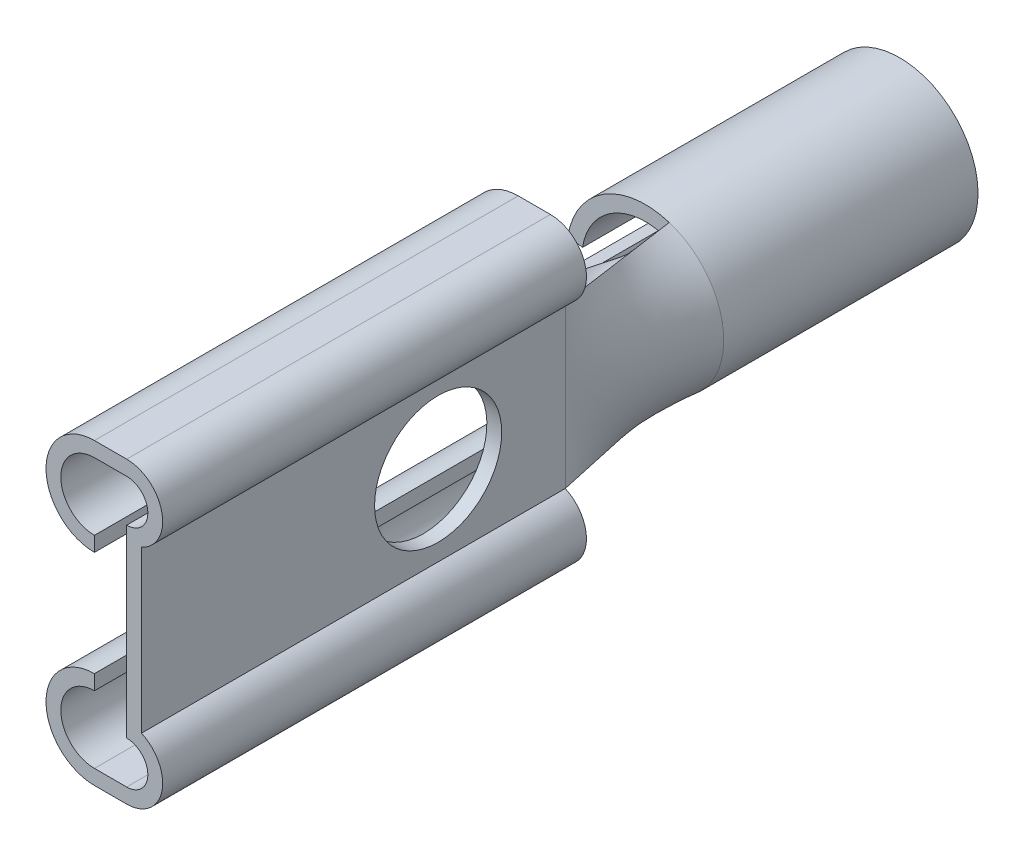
ISO-10303-21;
HEADER;
FILE_DESCRIPTION(('STEP AP214'),'2;1');
FILE_NAME('part.step','',(''),(''),'','','');
FILE_SCHEMA(('AUTOMOTIVE_DESIGN { 1 0 10303 214 1 1 1 1 }'));
ENDSEC;
DATA;
#1=APPLICATION_CONTEXT('core data for automotive mechanical design processes');
#2=APPLICATION_PROTOCOL_DEFINITION('international standard','automotive_design',2000,#1);
#3=PRODUCT_CONTEXT('',#1,'mechanical');
#4=PRODUCT('Part','Part','',(#3));
#5=PRODUCT_RELATED_PRODUCT_CATEGORY('part','',(#4));
#6=PRODUCT_DEFINITION_FORMATION('','',#4);
#7=PRODUCT_DEFINITION_CONTEXT('part definition',#1,'design');
#8=PRODUCT_DEFINITION('design','',#6,#7);
#9=PRODUCT_DEFINITION_SHAPE('','',#8);
#10=(LENGTH_UNIT() NAMED_UNIT(*) SI_UNIT(.MILLI.,.METRE.));
#11=(NAMED_UNIT(*) PLANE_ANGLE_UNIT() SI_UNIT($,.RADIAN.));
#12=(NAMED_UNIT(*) SI_UNIT($,.STERADIAN.) SOLID_ANGLE_UNIT());
#13=UNCERTAINTY_MEASURE_WITH_UNIT(LENGTH_MEASURE(1.E-05),#10,'distance_accuracy_value','');
#14=(GEOMETRIC_REPRESENTATION_CONTEXT(3) GLOBAL_UNCERTAINTY_ASSIGNED_CONTEXT((#13)) GLOBAL_UNIT_ASSIGNED_CONTEXT((#10,
#11,#12)) REPRESENTATION_CONTEXT('',''));
#15=CARTESIAN_POINT('',(0.,0.,0.));
#16=DIRECTION('',(0.,0.,1.));
#17=DIRECTION('',(1.,0.,0.));
#18=AXIS2_PLACEMENT_3D('',#15,#16,#17);
#19=CARTESIAN_POINT('',(0.759999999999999,2.675,0.));
#20=DIRECTION('',(0.,0.,1.));
#21=DIRECTION('',(1.,0.,0.));
#22=AXIS2_PLACEMENT_3D('',#19,#20,#21);
#23=PLANE('',#22);
#24=DIRECTION('',(0.786758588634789,0.617260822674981,0.));
#25=VECTOR('',#24,1.);
#26=CARTESIAN_POINT('',(0.759999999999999,-2.175,0.));
#27=LINE('',#26,#25);
#28=CARTESIAN_POINT('',(1.11,-1.90040333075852,0.));
#29=VERTEX_POINT('',#28);
#30=CARTESIAN_POINT('',(0.759999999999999,-2.175,0.));
#31=VERTEX_POINT('',#30);
#32=EDGE_CURVE('E12',#29,#31,#27,.F.);
#33=ORIENTED_EDGE('',*,*,#32,.F.);
#34=CARTESIAN_POINT('',(0.759999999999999,-2.675,0.));
#35=DIRECTION('',(0.,0.,-1.));
#36=DIRECTION('',(1.,0.,0.));
#37=AXIS2_PLACEMENT_3D('',#34,#35,#36);
#38=CIRCLE('',#37,0.85);
#39=CARTESIAN_POINT('',(0.759999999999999,-3.525,0.));
#40=VERTEX_POINT('',#39);
#41=EDGE_CURVE('E250',#40,#29,#38,.F.);
#42=ORIENTED_EDGE('',*,*,#41,.F.);
#43=DIRECTION('',(1.,0.,0.));
#44=VECTOR('',#43,1.);
#45=CARTESIAN_POINT('',(0.,-3.525,0.));
#46=LINE('',#45,#44);
#47=CARTESIAN_POINT('',(0.,-3.525,0.));
#48=VERTEX_POINT('',#47);
#49=EDGE_CURVE('E252',#48,#40,#46,.T.);
#50=ORIENTED_EDGE('',*,*,#49,.F.);
#51=CARTESIAN_POINT('',(0.,-2.38184886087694,0.));
#52=DIRECTION('',(0.,0.,-1.));
#53=DIRECTION('',(1.,0.,0.));
#54=AXIS2_PLACEMENT_3D('',#51,#52,#53);
#55=CIRCLE('',#54,1.14315113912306);
#56=CARTESIAN_POINT('',(0.,-1.23869772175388,0.));
#57=VERTEX_POINT('',#56);
#58=EDGE_CURVE('E531',#57,#48,#55,.F.);
#59=ORIENTED_EDGE('',*,*,#58,.F.);
#60=DIRECTION('',(0.,1.,0.));
#61=VECTOR('',#60,1.);
#62=CARTESIAN_POINT('',(0.,-1.58869772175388,0.));
#63=LINE('',#62,#61);
#64=CARTESIAN_POINT('',(0.,-1.58869772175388,0.));
#65=VERTEX_POINT('',#64);
#66=EDGE_CURVE('E534',#65,#57,#63,.T.);
#67=ORIENTED_EDGE('',*,*,#66,.F.);
#68=CARTESIAN_POINT('',(0.,-2.38184886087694,0.));
#69=DIRECTION('',(0.,0.,1.));
#70=DIRECTION('',(1.,0.,0.));
#71=AXIS2_PLACEMENT_3D('',#68,#69,#70);
#72=CIRCLE('',#71,0.793151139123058);
#73=CARTESIAN_POINT('',(0.,-3.175,0.));
#74=VERTEX_POINT('',#73);
#75=EDGE_CURVE('E540',#65,#74,#72,.T.);
#76=ORIENTED_EDGE('',*,*,#75,.T.);
#77=DIRECTION('',(1.,0.,0.));
#78=VECTOR('',#77,1.);
#79=CARTESIAN_POINT('',(0.,-3.175,0.));
#80=LINE('',#79,#78);
#81=CARTESIAN_POINT('',(0.759999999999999,-3.175,0.));
#82=VERTEX_POINT('',#81);
#83=EDGE_CURVE('E244',#74,#82,#80,.T.);
#84=ORIENTED_EDGE('',*,*,#83,.T.);
#85=CARTESIAN_POINT('',(0.759999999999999,-2.675,0.));
#86=DIRECTION('',(0.,0.,1.));
#87=DIRECTION('',(-1.,0.,0.));
#88=AXIS2_PLACEMENT_3D('',#85,#86,#87);
#89=CIRCLE('',#88,0.5);
#90=EDGE_CURVE('E241',#82,#31,#89,.T.);
#91=ORIENTED_EDGE('',*,*,#90,.T.);
#92=EDGE_LOOP('',(#33,#42,#50,#59,#67,#76,#84,#91));
#93=FACE_BOUND('',#92,.T.);
#94=ADVANCED_FACE('F55',(#93),#23,.F.);
#95=DIRECTION('',(-0.786758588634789,0.617260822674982,0.));
#96=VECTOR('',#95,1.);
#97=CARTESIAN_POINT('',(1.11,1.90040333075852,0.));
#98=LINE('',#97,#96);
#99=CARTESIAN_POINT('',(0.759999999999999,2.175,0.));
#100=VERTEX_POINT('',#99);
#101=CARTESIAN_POINT('',(1.11,1.90040333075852,0.));
#102=VERTEX_POINT('',#101);
#103=EDGE_CURVE('E66',#100,#102,#98,.F.);
#104=ORIENTED_EDGE('',*,*,#103,.F.);
#105=CARTESIAN_POINT('',(0.759999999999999,2.675,0.));
#106=DIRECTION('',(0.,0.,-1.));
#107=DIRECTION('',(-1.,0.,0.));
#108=AXIS2_PLACEMENT_3D('',#105,#106,#107);
#109=CIRCLE('',#108,0.5);
#110=CARTESIAN_POINT('',(0.759999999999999,3.175,0.));
#111=VERTEX_POINT('',#110);
#112=EDGE_CURVE('E222',#111,#100,#109,.T.);
#113=ORIENTED_EDGE('',*,*,#112,.F.);
#114=DIRECTION('',(1.,0.,0.));
#115=VECTOR('',#114,1.);
#116=CARTESIAN_POINT('',(0.,3.175,0.));
#117=LINE('',#116,#115);
#118=CARTESIAN_POINT('',(0.,3.175,0.));
#119=VERTEX_POINT('',#118);
#120=EDGE_CURVE('E220',#119,#111,#117,.T.);
#121=ORIENTED_EDGE('',*,*,#120,.F.);
#122=CARTESIAN_POINT('',(0.,2.38184886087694,0.));
#123=DIRECTION('',(0.,0.,-1.));
#124=DIRECTION('',(1.,0.,0.));
#125=AXIS2_PLACEMENT_3D('',#122,#123,#124);
#126=CIRCLE('',#125,0.793151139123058);
#127=CARTESIAN_POINT('',(0.,1.58869772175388,0.));
#128=VERTEX_POINT('',#127);
#129=EDGE_CURVE('E196',#128,#119,#126,.T.);
#130=ORIENTED_EDGE('',*,*,#129,.F.);
#131=DIRECTION('',(0.,-1.,0.));
#132=VECTOR('',#131,1.);
#133=CARTESIAN_POINT('',(0.,1.58869772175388,0.));
#134=LINE('',#133,#132);
#135=CARTESIAN_POINT('',(0.,1.23869772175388,0.));
#136=VERTEX_POINT('',#135);
#137=EDGE_CURVE('E216',#128,#136,#134,.T.);
#138=ORIENTED_EDGE('',*,*,#137,.T.);
#139=CARTESIAN_POINT('',(0.,2.38184886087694,0.));
#140=DIRECTION('',(0.,0.,1.));
#141=DIRECTION('',(1.,0.,0.));
#142=AXIS2_PLACEMENT_3D('',#139,#140,#141);
#143=CIRCLE('',#142,1.14315113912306);
#144=CARTESIAN_POINT('',(0.,3.525,0.));
#145=VERTEX_POINT('',#144);
#146=EDGE_CURVE('E212',#136,#145,#143,.F.);
#147=ORIENTED_EDGE('',*,*,#146,.T.);
#148=DIRECTION('',(1.,0.,0.));
#149=VECTOR('',#148,1.);
#150=CARTESIAN_POINT('',(0.,3.525,0.));
#151=LINE('',#150,#149);
#152=CARTESIAN_POINT('',(0.759999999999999,3.525,0.));
#153=VERTEX_POINT('',#152);
#154=EDGE_CURVE('E209',#145,#153,#151,.T.);
#155=ORIENTED_EDGE('',*,*,#154,.T.);
#156=CARTESIAN_POINT('',(0.759999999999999,2.675,0.));
#157=DIRECTION('',(0.,0.,1.));
#158=DIRECTION('',(1.,0.,0.));
#159=AXIS2_PLACEMENT_3D('',#156,#157,#158);
#160=CIRCLE('',#159,0.85);
#161=EDGE_CURVE('E213',#153,#102,#160,.F.);
#162=ORIENTED_EDGE('',*,*,#161,.T.);
#163=EDGE_LOOP('',(#104,#113,#121,#130,#138,#147,#155,#162));
#164=FACE_BOUND('',#163,.T.);
#165=ADVANCED_FACE('F452',(#164),#23,.F.);
#166=CARTESIAN_POINT('',(0.759999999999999,2.175,10.));
#167=DIRECTION('',(1.,0.,0.));
#168=DIRECTION('',(0.,1.,0.));
#169=AXIS2_PLACEMENT_3D('',#166,#167,#168);
#170=PLANE('',#169);
#171=CARTESIAN_POINT('',(0.759999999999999,0.,3.));
#172=DIRECTION('',(-1.,0.,0.));
#173=DIRECTION('',(0.,-1.,0.));
#174=AXIS2_PLACEMENT_3D('',#171,#172,#173);
#175=CIRCLE('',#174,1.5);
#176=CARTESIAN_POINT('',(0.759999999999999,-1.5,3.));
#177=VERTEX_POINT('',#176);
#178=EDGE_CURVE('E602',#177,#177,#175,.T.);
#179=ORIENTED_EDGE('',*,*,#178,.F.);
#180=EDGE_LOOP('',(#179));
#181=FACE_BOUND('',#180,.T.);
#182=DIRECTION('',(0.,1.,0.));
#183=VECTOR('',#182,1.);
#184=CARTESIAN_POINT('',(0.759999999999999,2.175,0.));
#185=LINE('',#184,#183);
#186=EDGE_CURVE('E257',#100,#31,#185,.F.);
#187=ORIENTED_EDGE('',*,*,#186,.T.);
#188=DIRECTION('',(0.,0.,-1.));
#189=VECTOR('',#188,1.);
#190=CARTESIAN_POINT('',(0.759999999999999,-2.175,10.));
#191=LINE('',#190,#189);
#192=CARTESIAN_POINT('',(0.759999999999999,-2.175,10.));
#193=VERTEX_POINT('',#192);
#194=EDGE_CURVE('E245',#193,#31,#191,.T.);
#195=ORIENTED_EDGE('',*,*,#194,.F.);
#196=DIRECTION('',(0.,-1.,0.));
#197=VECTOR('',#196,1.);
#198=CARTESIAN_POINT('',(0.759999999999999,2.175,10.));
#199=LINE('',#198,#197);
#200=CARTESIAN_POINT('',(0.759999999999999,2.175,10.));
#201=VERTEX_POINT('',#200);
#202=EDGE_CURVE('E238',#201,#193,#199,.T.);
#203=ORIENTED_EDGE('',*,*,#202,.F.);
#204=DIRECTION('',(0.,0.,-1.));
#205=VECTOR('',#204,1.);
#206=CARTESIAN_POINT('',(0.759999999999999,2.175,10.));
#207=LINE('',#206,#205);
#208=EDGE_CURVE('E205',#201,#100,#207,.T.);
#209=ORIENTED_EDGE('',*,*,#208,.T.);
#210=EDGE_LOOP('',(#187,#195,#203,#209));
#211=FACE_BOUND('',#210,.T.);
#212=ADVANCED_FACE('F57',(#181,#211),#170,.F.);
#213=CARTESIAN_POINT('',(1.11,2.175,10.));
#214=DIRECTION('',(1.,0.,0.));
#215=DIRECTION('',(0.,1.,0.));
#216=AXIS2_PLACEMENT_3D('',#213,#214,#215);
#217=PLANE('',#216);
#218=CARTESIAN_POINT('',(1.11,0.,3.));
#219=DIRECTION('',(1.,0.,0.));
#220=DIRECTION('',(0.,1.,0.));
#221=AXIS2_PLACEMENT_3D('',#218,#219,#220);
#222=CIRCLE('',#221,1.5);
#223=CARTESIAN_POINT('',(1.11,1.5,3.));
#224=VERTEX_POINT('',#223);
#225=EDGE_CURVE('E59',#224,#224,#222,.T.);
#226=ORIENTED_EDGE('',*,*,#225,.F.);
#227=EDGE_LOOP('',(#226));
#228=FACE_BOUND('',#227,.T.);
#229=DIRECTION('',(0.,1.,0.));
#230=VECTOR('',#229,1.);
#231=CARTESIAN_POINT('',(1.11,2.175,0.));
#232=LINE('',#231,#230);
#233=EDGE_CURVE('E233',#102,#29,#232,.F.);
#234=ORIENTED_EDGE('',*,*,#233,.F.);
#235=DIRECTION('',(0.,0.,-1.));
#236=VECTOR('',#235,1.);
#237=CARTESIAN_POINT('',(1.11,1.90040333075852,10.));
#238=LINE('',#237,#236);
#239=CARTESIAN_POINT('',(1.11,1.90040333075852,10.));
#240=VERTEX_POINT('',#239);
#241=EDGE_CURVE('E231',#240,#102,#238,.T.);
#242=ORIENTED_EDGE('',*,*,#241,.F.);
#243=DIRECTION('',(0.,-1.,0.));
#244=VECTOR('',#243,1.);
#245=CARTESIAN_POINT('',(1.11,2.175,10.));
#246=LINE('',#245,#244);
#247=CARTESIAN_POINT('',(1.11,-1.90040333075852,10.));
#248=VERTEX_POINT('',#247);
#249=EDGE_CURVE('E505',#240,#248,#246,.T.);
#250=ORIENTED_EDGE('',*,*,#249,.T.);
#251=DIRECTION('',(0.,0.,-1.));
#252=VECTOR('',#251,1.);
#253=CARTESIAN_POINT('',(1.11,-1.90040333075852,10.));
#254=LINE('',#253,#252);
#255=EDGE_CURVE('E254',#248,#29,#254,.T.);
#256=ORIENTED_EDGE('',*,*,#255,.T.);
#257=EDGE_LOOP('',(#234,#242,#250,#256));
#258=FACE_BOUND('',#257,.T.);
#259=ADVANCED_FACE('F474',(#228,#258),#217,.T.);
#260=CARTESIAN_POINT('',(0.759999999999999,2.675,10.));
#261=DIRECTION('',(0.,0.,-1.));
#262=DIRECTION('',(-1.,0.,0.));
#263=AXIS2_PLACEMENT_3D('',#260,#261,#262);
#264=CYLINDRICAL_SURFACE('',#263,0.85);
#265=ORIENTED_EDGE('',*,*,#161,.F.);
#266=DIRECTION('',(0.,0.,-1.));
#267=VECTOR('',#266,1.);
#268=CARTESIAN_POINT('',(0.759999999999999,3.525,10.));
#269=LINE('',#268,#267);
#270=CARTESIAN_POINT('',(0.759999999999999,3.525,10.));
#271=VERTEX_POINT('',#270);
#272=EDGE_CURVE('E229',#271,#153,#269,.T.);
#273=ORIENTED_EDGE('',*,*,#272,.F.);
#274=CARTESIAN_POINT('',(0.759999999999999,2.675,10.));
#275=DIRECTION('',(0.,0.,1.));
#276=DIRECTION('',(1.,0.,0.));
#277=AXIS2_PLACEMENT_3D('',#274,#275,#276);
#278=CIRCLE('',#277,0.85);
#279=EDGE_CURVE('E494',#271,#240,#278,.F.);
#280=ORIENTED_EDGE('',*,*,#279,.T.);
#281=ORIENTED_EDGE('',*,*,#241,.T.);
#282=EDGE_LOOP('',(#265,#273,#280,#281));
#283=FACE_BOUND('',#282,.T.);
#284=ADVANCED_FACE('F471',(#283),#264,.T.);
#285=CARTESIAN_POINT('',(0.,3.525,10.));
#286=DIRECTION('',(0.,1.,0.));
#287=DIRECTION('',(0.,0.,1.));
#288=AXIS2_PLACEMENT_3D('',#285,#286,#287);
#289=PLANE('',#288);
#290=ORIENTED_EDGE('',*,*,#154,.F.);
#291=DIRECTION('',(0.,0.,-1.));
#292=VECTOR('',#291,1.);
#293=CARTESIAN_POINT('',(0.,3.525,10.));
#294=LINE('',#293,#292);
#295=CARTESIAN_POINT('',(0.,3.525,10.));
#296=VERTEX_POINT('',#295);
#297=EDGE_CURVE('E227',#296,#145,#294,.T.);
#298=ORIENTED_EDGE('',*,*,#297,.F.);
#299=DIRECTION('',(1.,0.,0.));
#300=VECTOR('',#299,1.);
#301=CARTESIAN_POINT('',(0.,3.525,10.));
#302=LINE('',#301,#300);
#303=EDGE_CURVE('E512',#296,#271,#302,.T.);
#304=ORIENTED_EDGE('',*,*,#303,.T.);
#305=ORIENTED_EDGE('',*,*,#272,.T.);
#306=EDGE_LOOP('',(#290,#298,#304,#305));
#307=FACE_BOUND('',#306,.T.);
#308=ADVANCED_FACE('F467',(#307),#289,.T.);
#309=CARTESIAN_POINT('',(0.,2.38184886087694,10.));
#310=DIRECTION('',(0.,0.,-1.));
#311=DIRECTION('',(-1.,0.,0.));
#312=AXIS2_PLACEMENT_3D('',#309,#310,#311);
#313=CYLINDRICAL_SURFACE('',#312,1.14315113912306);
#314=ORIENTED_EDGE('',*,*,#146,.F.);
#315=DIRECTION('',(0.,0.,-1.));
#316=VECTOR('',#315,1.);
#317=CARTESIAN_POINT('',(0.,1.23869772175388,10.));
#318=LINE('',#317,#316);
#319=CARTESIAN_POINT('',(0.,1.23869772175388,10.));
#320=VERTEX_POINT('',#319);
#321=EDGE_CURVE('E225',#320,#136,#318,.T.);
#322=ORIENTED_EDGE('',*,*,#321,.F.);
#323=CARTESIAN_POINT('',(0.,2.38184886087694,10.));
#324=DIRECTION('',(0.,0.,1.));
#325=DIRECTION('',(1.,0.,0.));
#326=AXIS2_PLACEMENT_3D('',#323,#324,#325);
#327=CIRCLE('',#326,1.14315113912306);
#328=EDGE_CURVE('E515',#320,#296,#327,.F.);
#329=ORIENTED_EDGE('',*,*,#328,.T.);
#330=ORIENTED_EDGE('',*,*,#297,.T.);
#331=EDGE_LOOP('',(#314,#322,#329,#330));
#332=FACE_BOUND('',#331,.T.);
#333=ADVANCED_FACE('F463',(#332),#313,.T.);
#334=CARTESIAN_POINT('',(0.,1.58869772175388,10.));
#335=DIRECTION('',(1.,0.,0.));
#336=DIRECTION('',(0.,1.,0.));
#337=AXIS2_PLACEMENT_3D('',#334,#335,#336);
#338=PLANE('',#337);
#339=ORIENTED_EDGE('',*,*,#137,.F.);
#340=DIRECTION('',(0.,0.,-1.));
#341=VECTOR('',#340,1.);
#342=CARTESIAN_POINT('',(0.,1.58869772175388,10.));
#343=LINE('',#342,#341);
#344=CARTESIAN_POINT('',(0.,1.58869772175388,10.));
#345=VERTEX_POINT('',#344);
#346=EDGE_CURVE('E199',#345,#128,#343,.T.);
#347=ORIENTED_EDGE('',*,*,#346,.F.);
#348=DIRECTION('',(0.,-1.,0.));
#349=VECTOR('',#348,1.);
#350=CARTESIAN_POINT('',(0.,1.58869772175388,10.));
#351=LINE('',#350,#349);
#352=EDGE_CURVE('E189',#345,#320,#351,.T.);
#353=ORIENTED_EDGE('',*,*,#352,.T.);
#354=ORIENTED_EDGE('',*,*,#321,.T.);
#355=EDGE_LOOP('',(#339,#347,#353,#354));
#356=FACE_BOUND('',#355,.T.);
#357=ADVANCED_FACE('F460',(#356),#338,.T.);
#358=CARTESIAN_POINT('',(0.,2.38184886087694,10.));
#359=DIRECTION('',(0.,0.,-1.));
#360=DIRECTION('',(-1.,0.,0.));
#361=AXIS2_PLACEMENT_3D('',#358,#359,#360);
#362=CYLINDRICAL_SURFACE('',#361,0.793151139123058);
#363=ORIENTED_EDGE('',*,*,#129,.T.);
#364=DIRECTION('',(0.,0.,-1.));
#365=VECTOR('',#364,1.);
#366=CARTESIAN_POINT('',(0.,3.175,10.));
#367=LINE('',#366,#365);
#368=CARTESIAN_POINT('',(0.,3.175,10.));
#369=VERTEX_POINT('',#368);
#370=EDGE_CURVE('E193',#369,#119,#367,.T.);
#371=ORIENTED_EDGE('',*,*,#370,.F.);
#372=CARTESIAN_POINT('',(0.,2.38184886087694,10.));
#373=DIRECTION('',(0.,0.,-1.));
#374=DIRECTION('',(1.,0.,0.));
#375=AXIS2_PLACEMENT_3D('',#372,#373,#374);
#376=CIRCLE('',#375,0.793151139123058);
#377=EDGE_CURVE('E181',#345,#369,#376,.T.);
#378=ORIENTED_EDGE('',*,*,#377,.F.);
#379=ORIENTED_EDGE('',*,*,#346,.T.);
#380=EDGE_LOOP('',(#363,#371,#378,#379));
#381=FACE_BOUND('',#380,.T.);
#382=ADVANCED_FACE('F194',(#381),#362,.F.);
#383=CARTESIAN_POINT('',(0.,3.175,10.));
#384=DIRECTION('',(0.,1.,0.));
#385=DIRECTION('',(0.,0.,1.));
#386=AXIS2_PLACEMENT_3D('',#383,#384,#385);
#387=PLANE('',#386);
#388=ORIENTED_EDGE('',*,*,#120,.T.);
#389=DIRECTION('',(0.,0.,-1.));
#390=VECTOR('',#389,1.);
#391=CARTESIAN_POINT('',(0.759999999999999,3.175,10.));
#392=LINE('',#391,#390);
#393=CARTESIAN_POINT('',(0.759999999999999,3.175,10.));
#394=VERTEX_POINT('',#393);
#395=EDGE_CURVE('E200',#394,#111,#392,.T.);
#396=ORIENTED_EDGE('',*,*,#395,.F.);
#397=DIRECTION('',(1.,0.,0.));
#398=VECTOR('',#397,1.);
#399=CARTESIAN_POINT('',(0.,3.175,10.));
#400=LINE('',#399,#398);
#401=EDGE_CURVE('E185',#369,#394,#400,.T.);
#402=ORIENTED_EDGE('',*,*,#401,.F.);
#403=ORIENTED_EDGE('',*,*,#370,.T.);
#404=EDGE_LOOP('',(#388,#396,#402,#403));
#405=FACE_BOUND('',#404,.T.);
#406=ADVANCED_FACE('F202',(#405),#387,.F.);
#407=CARTESIAN_POINT('',(0.759999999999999,2.675,10.));
#408=DIRECTION('',(0.,0.,-1.));
#409=DIRECTION('',(-1.,0.,0.));
#410=AXIS2_PLACEMENT_3D('',#407,#408,#409);
#411=CYLINDRICAL_SURFACE('',#410,0.5);
#412=ORIENTED_EDGE('',*,*,#112,.T.);
#413=ORIENTED_EDGE('',*,*,#208,.F.);
#414=CARTESIAN_POINT('',(0.759999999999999,2.675,10.));
#415=DIRECTION('',(0.,0.,-1.));
#416=DIRECTION('',(-1.,0.,0.));
#417=AXIS2_PLACEMENT_3D('',#414,#415,#416);
#418=CIRCLE('',#417,0.5);
#419=EDGE_CURVE('E75',#394,#201,#418,.T.);
#420=ORIENTED_EDGE('',*,*,#419,.F.);
#421=ORIENTED_EDGE('',*,*,#395,.T.);
#422=EDGE_LOOP('',(#412,#413,#420,#421));
#423=FACE_BOUND('',#422,.T.);
#424=ADVANCED_FACE('F449',(#423),#411,.F.);
#425=CARTESIAN_POINT('',(0.759999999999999,2.675,10.));
#426=DIRECTION('',(0.,0.,1.));
#427=DIRECTION('',(1.,0.,0.));
#428=AXIS2_PLACEMENT_3D('',#425,#426,#427);
#429=PLANE('',#428);
#430=ORIENTED_EDGE('',*,*,#202,.T.);
#431=CARTESIAN_POINT('',(0.759999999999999,-2.675,10.));
#432=DIRECTION('',(0.,0.,1.));
#433=DIRECTION('',(-1.,0.,0.));
#434=AXIS2_PLACEMENT_3D('',#431,#432,#433);
#435=CIRCLE('',#434,0.5);
#436=CARTESIAN_POINT('',(0.759999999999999,-3.175,10.));
#437=VERTEX_POINT('',#436);
#438=EDGE_CURVE('E249',#437,#193,#435,.T.);
#439=ORIENTED_EDGE('',*,*,#438,.F.);
#440=DIRECTION('',(1.,0.,0.));
#441=VECTOR('',#440,1.);
#442=CARTESIAN_POINT('',(0.,-3.175,10.));
#443=LINE('',#442,#441);
#444=CARTESIAN_POINT('',(0.,-3.175,10.));
#445=VERTEX_POINT('',#444);
#446=EDGE_CURVE('E567',#445,#437,#443,.T.);
#447=ORIENTED_EDGE('',*,*,#446,.F.);
#448=CARTESIAN_POINT('',(0.,-2.38184886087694,10.));
#449=DIRECTION('',(0.,0.,1.));
#450=DIRECTION('',(1.,0.,0.));
#451=AXIS2_PLACEMENT_3D('',#448,#449,#450);
#452=CIRCLE('',#451,0.793151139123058);
#453=CARTESIAN_POINT('',(0.,-1.58869772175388,10.));
#454=VERTEX_POINT('',#453);
#455=EDGE_CURVE('E565',#454,#445,#452,.T.);
#456=ORIENTED_EDGE('',*,*,#455,.F.);
#457=DIRECTION('',(0.,1.,0.));
#458=VECTOR('',#457,1.);
#459=CARTESIAN_POINT('',(0.,-1.58869772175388,10.));
#460=LINE('',#459,#458);
#461=CARTESIAN_POINT('',(0.,-1.23869772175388,10.));
#462=VERTEX_POINT('',#461);
#463=EDGE_CURVE('E561',#454,#462,#460,.T.);
#464=ORIENTED_EDGE('',*,*,#463,.T.);
#465=CARTESIAN_POINT('',(0.,-2.38184886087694,10.));
#466=DIRECTION('',(0.,0.,-1.));
#467=DIRECTION('',(1.,0.,0.));
#468=AXIS2_PLACEMENT_3D('',#465,#466,#467);
#469=CIRCLE('',#468,1.14315113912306);
#470=CARTESIAN_POINT('',(0.,-3.525,10.));
#471=VERTEX_POINT('',#470);
#472=EDGE_CURVE('E558',#462,#471,#469,.F.);
#473=ORIENTED_EDGE('',*,*,#472,.T.);
#474=DIRECTION('',(1.,0.,0.));
#475=VECTOR('',#474,1.);
#476=CARTESIAN_POINT('',(0.,-3.525,10.));
#477=LINE('',#476,#475);
#478=CARTESIAN_POINT('',(0.759999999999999,-3.525,10.));
#479=VERTEX_POINT('',#478);
#480=EDGE_CURVE('E524',#471,#479,#477,.T.);
#481=ORIENTED_EDGE('',*,*,#480,.T.);
#482=CARTESIAN_POINT('',(0.759999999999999,-2.675,10.));
#483=DIRECTION('',(0.,0.,-1.));
#484=DIRECTION('',(1.,0.,0.));
#485=AXIS2_PLACEMENT_3D('',#482,#483,#484);
#486=CIRCLE('',#485,0.85);
#487=EDGE_CURVE('E243',#479,#248,#486,.F.);
#488=ORIENTED_EDGE('',*,*,#487,.T.);
#489=ORIENTED_EDGE('',*,*,#249,.F.);
#490=ORIENTED_EDGE('',*,*,#279,.F.);
#491=ORIENTED_EDGE('',*,*,#303,.F.);
#492=ORIENTED_EDGE('',*,*,#328,.F.);
#493=ORIENTED_EDGE('',*,*,#352,.F.);
#494=ORIENTED_EDGE('',*,*,#377,.T.);
#495=ORIENTED_EDGE('',*,*,#401,.T.);
#496=ORIENTED_EDGE('',*,*,#419,.T.);
#497=EDGE_LOOP('',(#430,#439,#447,#456,#464,#473,#481,#488,#489,#490,#491,#492,#493,#494,#495,#496));
#498=FACE_BOUND('',#497,.T.);
#499=ADVANCED_FACE('F183',(#498),#429,.T.);
#500=CARTESIAN_POINT('',(0.759999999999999,-2.675,10.));
#501=DIRECTION('',(0.,0.,-1.));
#502=DIRECTION('',(-1.,0.,0.));
#503=AXIS2_PLACEMENT_3D('',#500,#501,#502);
#504=CYLINDRICAL_SURFACE('',#503,0.85);
#505=ORIENTED_EDGE('',*,*,#41,.T.);
#506=ORIENTED_EDGE('',*,*,#255,.F.);
#507=ORIENTED_EDGE('',*,*,#487,.F.);
#508=DIRECTION('',(0.,0.,-1.));
#509=VECTOR('',#508,1.);
#510=CARTESIAN_POINT('',(0.759999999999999,-3.525,10.));
#511=LINE('',#510,#509);
#512=EDGE_CURVE('E258',#479,#40,#511,.T.);
#513=ORIENTED_EDGE('',*,*,#512,.T.);
#514=EDGE_LOOP('',(#505,#506,#507,#513));
#515=FACE_BOUND('',#514,.T.);
#516=ADVANCED_FACE('F442',(#515),#504,.T.);
#517=CARTESIAN_POINT('',(0.,-3.525,10.));
#518=DIRECTION('',(0.,-1.,0.));
#519=DIRECTION('',(0.,0.,1.));
#520=AXIS2_PLACEMENT_3D('',#517,#518,#519);
#521=PLANE('',#520);
#522=ORIENTED_EDGE('',*,*,#49,.T.);
#523=ORIENTED_EDGE('',*,*,#512,.F.);
#524=ORIENTED_EDGE('',*,*,#480,.F.);
#525=DIRECTION('',(0.,0.,-1.));
#526=VECTOR('',#525,1.);
#527=CARTESIAN_POINT('',(0.,-3.525,10.));
#528=LINE('',#527,#526);
#529=EDGE_CURVE('E555',#471,#48,#528,.T.);
#530=ORIENTED_EDGE('',*,*,#529,.T.);
#531=EDGE_LOOP('',(#522,#523,#524,#530));
#532=FACE_BOUND('',#531,.T.);
#533=ADVANCED_FACE('F438',(#532),#521,.T.);
#534=CARTESIAN_POINT('',(0.,-2.38184886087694,10.));
#535=DIRECTION('',(0.,0.,-1.));
#536=DIRECTION('',(-1.,0.,0.));
#537=AXIS2_PLACEMENT_3D('',#534,#535,#536);
#538=CYLINDRICAL_SURFACE('',#537,1.14315113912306);
#539=ORIENTED_EDGE('',*,*,#58,.T.);
#540=ORIENTED_EDGE('',*,*,#529,.F.);
#541=ORIENTED_EDGE('',*,*,#472,.F.);
#542=DIRECTION('',(0.,0.,-1.));
#543=VECTOR('',#542,1.);
#544=CARTESIAN_POINT('',(0.,-1.23869772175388,10.));
#545=LINE('',#544,#543);
#546=EDGE_CURVE('E553',#462,#57,#545,.T.);
#547=ORIENTED_EDGE('',*,*,#546,.T.);
#548=EDGE_LOOP('',(#539,#540,#541,#547));
#549=FACE_BOUND('',#548,.T.);
#550=ADVANCED_FACE('F434',(#549),#538,.T.);
#551=CARTESIAN_POINT('',(0.,-1.58869772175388,10.));
#552=DIRECTION('',(1.,0.,0.));
#553=DIRECTION('',(0.,-1.,0.));
#554=AXIS2_PLACEMENT_3D('',#551,#552,#553);
#555=PLANE('',#554);
#556=ORIENTED_EDGE('',*,*,#66,.T.);
#557=ORIENTED_EDGE('',*,*,#546,.F.);
#558=ORIENTED_EDGE('',*,*,#463,.F.);
#559=DIRECTION('',(0.,0.,-1.));
#560=VECTOR('',#559,1.);
#561=CARTESIAN_POINT('',(0.,-1.58869772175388,10.));
#562=LINE('',#561,#560);
#563=EDGE_CURVE('E550',#454,#65,#562,.T.);
#564=ORIENTED_EDGE('',*,*,#563,.T.);
#565=EDGE_LOOP('',(#556,#557,#558,#564));
#566=FACE_BOUND('',#565,.T.);
#567=ADVANCED_FACE('F430',(#566),#555,.T.);
#568=CARTESIAN_POINT('',(0.,-2.38184886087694,10.));
#569=DIRECTION('',(0.,0.,-1.));
#570=DIRECTION('',(-1.,0.,0.));
#571=AXIS2_PLACEMENT_3D('',#568,#569,#570);
#572=CYLINDRICAL_SURFACE('',#571,0.793151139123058);
#573=ORIENTED_EDGE('',*,*,#75,.F.);
#574=ORIENTED_EDGE('',*,*,#563,.F.);
#575=ORIENTED_EDGE('',*,*,#455,.T.);
#576=DIRECTION('',(0.,0.,-1.));
#577=VECTOR('',#576,1.);
#578=CARTESIAN_POINT('',(0.,-3.175,10.));
#579=LINE('',#578,#577);
#580=EDGE_CURVE('E547',#445,#74,#579,.T.);
#581=ORIENTED_EDGE('',*,*,#580,.T.);
#582=EDGE_LOOP('',(#573,#574,#575,#581));
#583=FACE_BOUND('',#582,.T.);
#584=ADVANCED_FACE('F426',(#583),#572,.F.);
#585=CARTESIAN_POINT('',(0.,-3.175,10.));
#586=DIRECTION('',(0.,-1.,0.));
#587=DIRECTION('',(0.,0.,1.));
#588=AXIS2_PLACEMENT_3D('',#585,#586,#587);
#589=PLANE('',#588);
#590=ORIENTED_EDGE('',*,*,#83,.F.);
#591=ORIENTED_EDGE('',*,*,#580,.F.);
#592=ORIENTED_EDGE('',*,*,#446,.T.);
#593=DIRECTION('',(0.,0.,-1.));
#594=VECTOR('',#593,1.);
#595=CARTESIAN_POINT('',(0.759999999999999,-3.175,10.));
#596=LINE('',#595,#594);
#597=EDGE_CURVE('E248',#437,#82,#596,.T.);
#598=ORIENTED_EDGE('',*,*,#597,.T.);
#599=EDGE_LOOP('',(#590,#591,#592,#598));
#600=FACE_BOUND('',#599,.T.);
#601=ADVANCED_FACE('F422',(#600),#589,.F.);
#602=CARTESIAN_POINT('',(0.759999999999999,-2.675,10.));
#603=DIRECTION('',(0.,0.,-1.));
#604=DIRECTION('',(-1.,0.,0.));
#605=AXIS2_PLACEMENT_3D('',#602,#603,#604);
#606=CYLINDRICAL_SURFACE('',#605,0.5);
#607=ORIENTED_EDGE('',*,*,#90,.F.);
#608=ORIENTED_EDGE('',*,*,#597,.F.);
#609=ORIENTED_EDGE('',*,*,#438,.T.);
#610=ORIENTED_EDGE('',*,*,#194,.T.);
#611=EDGE_LOOP('',(#607,#608,#609,#610));
#612=FACE_BOUND('',#611,.T.);
#613=ADVANCED_FACE('F413',(#612),#606,.F.);
#614=CARTESIAN_POINT('',(0.563031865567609,-1.39032194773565,-3.));
#615=CARTESIAN_POINT('',(0.759999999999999,-2.175,0.));
#616=CARTESIAN_POINT('',(0.563031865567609,-1.45230854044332,-3.));
#617=CARTESIAN_POINT('',(0.818333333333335,-2.12923388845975,0.));
#618=CARTESIAN_POINT('',(0.563031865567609,-1.51429513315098,-3.));
#619=CARTESIAN_POINT('',(0.87666666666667,-2.0834677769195,0.));
#620=CARTESIAN_POINT('',(0.563031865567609,-1.63826831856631,-3.));
#621=CARTESIAN_POINT('',(0.993333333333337,-1.99193555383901,0.));
#622=CARTESIAN_POINT('',(0.563031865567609,-1.70025491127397,-3.));
#623=CARTESIAN_POINT('',(1.05166666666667,-1.94616944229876,0.));
#624=CARTESIAN_POINT('',(0.563031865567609,-1.76224150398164,-3.));
#625=CARTESIAN_POINT('',(1.11,-1.90040333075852,0.));
#626=B_SPLINE_SURFACE_WITH_KNOTS('',3,1,((#614,#615),(#616,#617),(#618,#619),(#620,#621),(#622,
#623),(#624,#625)),.UNSPECIFIED.,.F.,.F.,.F.,(4,2,4),(2,2),(0.,0.5,1.),(0.,1.),.UNSPECIFIED.);
#627=DIRECTION('',(0.,-1.,0.));
#628=VECTOR('',#627,1.);
#629=CARTESIAN_POINT('',(0.563031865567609,0.,-3.));
#630=LINE('',#629,#628);
#631=CARTESIAN_POINT('',(0.563031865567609,-1.39032194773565,-3.));
#632=VERTEX_POINT('',#631);
#633=CARTESIAN_POINT('',(0.563031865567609,-1.76224150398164,-3.));
#634=VERTEX_POINT('',#633);
#635=EDGE_CURVE('E253',#632,#634,#630,.T.);
#636=DIRECTION('',(0.179182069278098,-0.0452606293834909,0.98277426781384));
#637=VECTOR('',#636,1.);
#638=CARTESIAN_POINT('',(0.836515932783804,-1.83132241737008,-1.5));
#639=LINE('',#638,#637);
#640=EDGE_CURVE('E570',#634,#29,#639,.T.);
#641=DIRECTION('',(-0.063391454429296,0.252537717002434,-0.965508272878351));
#642=VECTOR('',#641,1.);
#643=CARTESIAN_POINT('',(0.661515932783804,-1.78266097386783,-1.5));
#644=LINE('',#643,#642);
#645=EDGE_CURVE('E368',#31,#632,#644,.T.);
#646=ORIENTED_EDGE('',*,*,#635,.T.);
#647=ORIENTED_EDGE('',*,*,#640,.T.);
#648=ORIENTED_EDGE('',*,*,#32,.T.);
#649=ORIENTED_EDGE('',*,*,#645,.T.);
#650=EDGE_LOOP('',(#646,#647,#648,#649));
#651=FACE_BOUND('',#650,.T.);
#652=ADVANCED_FACE('F421',(#651),#626,.T.);
#653=CARTESIAN_POINT('',(0.563031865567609,-1.76224150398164,-3.));
#654=CARTESIAN_POINT('',(1.11,-1.90040333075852,0.));
#655=CARTESIAN_POINT('',(0.702919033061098,-1.71754789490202,-3.));
#656=CARTESIAN_POINT('',(1.11,-1.74203638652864,0.));
#657=CARTESIAN_POINT('',(0.850187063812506,-1.65217564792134,-3.));
#658=CARTESIAN_POINT('',(1.11,-1.58366944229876,0.));
#659=CARTESIAN_POINT('',(1.14210245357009,-1.46564129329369,-3.));
#660=CARTESIAN_POINT('',(1.11,-1.26693555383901,0.));
#661=CARTESIAN_POINT('',(1.28667153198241,-1.34404314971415,-3.));
#662=CARTESIAN_POINT('',(1.11,-1.10856860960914,0.));
#663=CARTESIAN_POINT('',(1.54272960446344,-1.04017353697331,-3.));
#664=CARTESIAN_POINT('',(1.11,-0.791834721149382,0.));
#665=CARTESIAN_POINT('',(1.65363944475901,-0.857591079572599,-3.));
#666=CARTESIAN_POINT('',(1.11,-0.633467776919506,0.));
#667=CARTESIAN_POINT('',(1.80764768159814,-0.44988413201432,-3.));
#668=CARTESIAN_POINT('',(1.11,-0.316733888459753,0.));
#669=CARTESIAN_POINT('',(1.85,-0.225176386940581,-3.));
#670=CARTESIAN_POINT('',(1.11,-0.158366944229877,0.));
#671=CARTESIAN_POINT('',(1.85,0.225176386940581,-3.));
#672=CARTESIAN_POINT('',(1.11,0.158366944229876,0.));
#673=CARTESIAN_POINT('',(1.80764768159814,0.44988413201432,-3.));
#674=CARTESIAN_POINT('',(1.11,0.316733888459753,0.));
#675=CARTESIAN_POINT('',(1.65363944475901,0.857591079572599,-3.));
#676=CARTESIAN_POINT('',(1.11,0.633467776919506,0.));
#677=CARTESIAN_POINT('',(1.54272960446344,1.04017353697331,-3.));
#678=CARTESIAN_POINT('',(1.11,0.791834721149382,0.));
#679=CARTESIAN_POINT('',(1.28667153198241,1.34404314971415,-3.));
#680=CARTESIAN_POINT('',(1.11,1.10856860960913,0.));
#681=CARTESIAN_POINT('',(1.14210245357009,1.46564129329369,-3.));
#682=CARTESIAN_POINT('',(1.11,1.26693555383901,0.));
#683=CARTESIAN_POINT('',(0.850187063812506,1.65217564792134,-3.));
#684=CARTESIAN_POINT('',(1.11,1.58366944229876,0.));
#685=CARTESIAN_POINT('',(0.702919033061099,1.71754789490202,-3.));
#686=CARTESIAN_POINT('',(1.11,1.74203638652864,0.));
#687=CARTESIAN_POINT('',(0.563031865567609,1.76224150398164,-3.));
#688=CARTESIAN_POINT('',(1.11,1.90040333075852,0.));
#689=B_SPLINE_SURFACE_WITH_KNOTS('',3,1,((#653,#654),(#655,#656),(#657,#658),(#659,#660),(#661,
#662),(#663,#664),(#665,#666),(#667,#668),(#669,#670),(#671,#672),(#673,#674),(#675,#676),(#677,
#678),(#679,#680),(#681,#682),(#683,#684),(#685,#686),(#687,#688)),.UNSPECIFIED.,.F.,.F.,.F.,(4,
2,2,2,2,2,2,2,4),(2,2),(0.,0.125,0.25,0.375,0.5,0.625,0.75,0.875,1.),(0.,1.),.UNSPECIFIED.);
#690=CARTESIAN_POINT('',(0.,0.,-3.));
#691=DIRECTION('',(0.,0.,1.));
#692=DIRECTION('',(1.,0.,0.));
#693=AXIS2_PLACEMENT_3D('',#690,#691,#692);
#694=CIRCLE('',#693,1.85);
#695=CARTESIAN_POINT('',(0.933007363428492,-1.5985299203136,-3.));
#696=VERTEX_POINT('',#695);
#697=EDGE_CURVE('E360',#634,#696,#694,.T.);
#698=CARTESIAN_POINT('',(0.563031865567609,-1.76224150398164,-3.));
#699=CARTESIAN_POINT('',(0.702919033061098,-1.71754789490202,-3.));
#700=CARTESIAN_POINT('',(0.850187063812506,-1.65217564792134,-3.));
#701=CARTESIAN_POINT('',(1.14210245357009,-1.46564129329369,-3.));
#702=CARTESIAN_POINT('',(1.28667153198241,-1.34404314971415,-3.));
#703=CARTESIAN_POINT('',(1.54272960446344,-1.04017353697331,-3.));
#704=CARTESIAN_POINT('',(1.65363944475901,-0.857591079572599,-3.));
#705=CARTESIAN_POINT('',(1.80764768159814,-0.44988413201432,-3.));
#706=CARTESIAN_POINT('',(1.85,-0.225176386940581,-3.));
#707=CARTESIAN_POINT('',(1.85,0.225176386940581,-3.));
#708=CARTESIAN_POINT('',(1.80764768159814,0.44988413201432,-3.));
#709=CARTESIAN_POINT('',(1.65363944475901,0.857591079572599,-3.));
#710=CARTESIAN_POINT('',(1.54272960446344,1.04017353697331,-3.));
#711=CARTESIAN_POINT('',(1.28667153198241,1.34404314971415,-3.));
#712=CARTESIAN_POINT('',(1.14210245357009,1.46564129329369,-3.));
#713=CARTESIAN_POINT('',(0.850187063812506,1.65217564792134,-3.));
#714=CARTESIAN_POINT('',(0.702919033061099,1.71754789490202,-3.));
#715=CARTESIAN_POINT('',(0.563031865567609,1.76224150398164,-3.));
#716=B_SPLINE_CURVE_WITH_KNOTS('',3,(#698,#699,#700,#701,#702,#703,#704,#705,#706,#707,#708,
#709,#710,#711,#712,#713,#714,#715),.UNSPECIFIED.,.F.,.F.,(4,2,2,2,2,2,2,2,4),(0.,0.125,0.25,
0.375,0.5,0.625,0.75,0.875,1.),.UNSPECIFIED.);
#717=CARTESIAN_POINT('',(0.932981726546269,1.59848365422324,-3.));
#718=VERTEX_POINT('',#717);
#719=EDGE_CURVE('E593',#696,#718,#716,.T.);
#720=CARTESIAN_POINT('',(0.563031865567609,-1.76224150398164,-3.));
#721=CARTESIAN_POINT('',(0.702919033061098,-1.71754789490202,-3.));
#722=CARTESIAN_POINT('',(0.850187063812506,-1.65217564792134,-3.));
#723=CARTESIAN_POINT('',(1.14210245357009,-1.46564129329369,-3.));
#724=CARTESIAN_POINT('',(1.28667153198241,-1.34404314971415,-3.));
#725=CARTESIAN_POINT('',(1.54272960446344,-1.04017353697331,-3.));
#726=CARTESIAN_POINT('',(1.65363944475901,-0.857591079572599,-3.));
#727=CARTESIAN_POINT('',(1.80764768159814,-0.44988413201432,-3.));
#728=CARTESIAN_POINT('',(1.85,-0.225176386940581,-3.));
#729=CARTESIAN_POINT('',(1.85,0.225176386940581,-3.));
#730=CARTESIAN_POINT('',(1.80764768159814,0.44988413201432,-3.));
#731=CARTESIAN_POINT('',(1.65363944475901,0.857591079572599,-3.));
#732=CARTESIAN_POINT('',(1.54272960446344,1.04017353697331,-3.));
#733=CARTESIAN_POINT('',(1.28667153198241,1.34404314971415,-3.));
#734=CARTESIAN_POINT('',(1.14210245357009,1.46564129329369,-3.));
#735=CARTESIAN_POINT('',(0.850187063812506,1.65217564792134,-3.));
#736=CARTESIAN_POINT('',(0.702919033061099,1.71754789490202,-3.));
#737=CARTESIAN_POINT('',(0.563031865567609,1.76224150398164,-3.));
#738=B_SPLINE_CURVE_WITH_KNOTS('',3,(#720,#721,#722,#723,#724,#725,#726,#727,#728,#729,#730,
#731,#732,#733,#734,#735,#736,#737),.UNSPECIFIED.,.F.,.F.,(4,2,2,2,2,2,2,2,4),(0.,0.125,0.25,
0.375,0.5,0.625,0.75,0.875,1.),.UNSPECIFIED.);
#739=CARTESIAN_POINT('',(0.563031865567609,1.76224150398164,-3.));
#740=VERTEX_POINT('',#739);
#741=EDGE_CURVE('E498',#718,#740,#738,.T.);
#742=DIRECTION('',(0.179182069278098,0.0452606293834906,0.98277426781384));
#743=VECTOR('',#742,1.);
#744=CARTESIAN_POINT('',(0.836515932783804,1.83132241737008,-1.5));
#745=LINE('',#744,#743);
#746=EDGE_CURVE('E356',#740,#102,#745,.T.);
#747=ORIENTED_EDGE('',*,*,#697,.T.);
#748=ORIENTED_EDGE('',*,*,#719,.T.);
#749=ORIENTED_EDGE('',*,*,#741,.T.);
#750=ORIENTED_EDGE('',*,*,#746,.T.);
#751=ORIENTED_EDGE('',*,*,#233,.T.);
#752=ORIENTED_EDGE('',*,*,#640,.F.);
#753=EDGE_LOOP('',(#747,#748,#749,#750,#751,#752));
#754=FACE_BOUND('',#753,.T.);
#755=ADVANCED_FACE('F397',(#754),#689,.T.);
#756=CARTESIAN_POINT('',(0.56303186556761,1.39032194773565,-3.));
#757=CARTESIAN_POINT('',(0.759999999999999,2.175,0.));
#758=CARTESIAN_POINT('',(0.670420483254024,1.34683330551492,-3.));
#759=CARTESIAN_POINT('',(0.759999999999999,1.99375,0.));
#760=CARTESIAN_POINT('',(0.781488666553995,1.28735554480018,-3.));
#761=CARTESIAN_POINT('',(0.759999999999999,1.8125,0.));
#762=CARTESIAN_POINT('',(0.997594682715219,1.1281904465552,-3.));
#763=CARTESIAN_POINT('',(0.759999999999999,1.45,0.));
#764=CARTESIAN_POINT('',(1.10253603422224,1.02825404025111,-3.));
#765=CARTESIAN_POINT('',(0.759999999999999,1.26875,0.));
#766=CARTESIAN_POINT('',(1.28567265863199,0.787361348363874,-3.));
#767=CARTESIAN_POINT('',(0.759999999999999,0.906249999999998,0.));
#768=CARTESIAN_POINT('',(1.36351301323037,0.646275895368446,-3.));
#769=CARTESIAN_POINT('',(0.759999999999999,0.724999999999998,0.));
#770=CARTESIAN_POINT('',(1.4708740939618,0.33670412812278,-3.));
#771=CARTESIAN_POINT('',(0.759999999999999,0.362499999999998,0.));
#772=CARTESIAN_POINT('',(1.5,0.168480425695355,-3.));
#773=CARTESIAN_POINT('',(0.759999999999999,0.181249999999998,0.));
#774=CARTESIAN_POINT('',(1.5,-0.168480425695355,-3.));
#775=CARTESIAN_POINT('',(0.759999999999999,-0.181250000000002,0.));
#776=CARTESIAN_POINT('',(1.4708740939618,-0.336704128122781,-3.));
#777=CARTESIAN_POINT('',(0.759999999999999,-0.362500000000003,0.));
#778=CARTESIAN_POINT('',(1.36351301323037,-0.646275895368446,-3.));
#779=CARTESIAN_POINT('',(0.759999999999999,-0.725000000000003,0.));
#780=CARTESIAN_POINT('',(1.28567265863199,-0.787361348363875,-3.));
#781=CARTESIAN_POINT('',(0.759999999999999,-0.906250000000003,0.));
#782=CARTESIAN_POINT('',(1.10253603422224,-1.02825404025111,-3.));
#783=CARTESIAN_POINT('',(0.759999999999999,-1.26875,0.));
#784=CARTESIAN_POINT('',(0.997594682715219,-1.1281904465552,-3.));
#785=CARTESIAN_POINT('',(0.759999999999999,-1.45,0.));
#786=CARTESIAN_POINT('',(0.781488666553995,-1.28735554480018,-3.));
#787=CARTESIAN_POINT('',(0.759999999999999,-1.8125,0.));
#788=CARTESIAN_POINT('',(0.670420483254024,-1.34683330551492,-3.));
#789=CARTESIAN_POINT('',(0.759999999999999,-1.99375,0.));
#790=CARTESIAN_POINT('',(0.563031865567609,-1.39032194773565,-3.));
#791=CARTESIAN_POINT('',(0.759999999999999,-2.175,0.));
#792=B_SPLINE_SURFACE_WITH_KNOTS('',3,1,((#756,#757),(#758,#759),(#760,#761),(#762,#763),(#764,
#765),(#766,#767),(#768,#769),(#770,#771),(#772,#773),(#774,#775),(#776,#777),(#778,#779),(#780,
#781),(#782,#783),(#784,#785),(#786,#787),(#788,#789),(#790,#791)),.UNSPECIFIED.,.F.,.F.,.F.,(4,
2,2,2,2,2,2,2,4),(2,2),(0.,0.125,0.25,0.375,0.5,0.625,0.75,0.875,1.),(0.,1.),.UNSPECIFIED.);
#793=DIRECTION('',(0.063391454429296,0.252537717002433,0.965508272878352));
#794=VECTOR('',#793,1.);
#795=CARTESIAN_POINT('',(0.661515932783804,1.78266097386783,-1.5));
#796=LINE('',#795,#794);
#797=CARTESIAN_POINT('',(0.563031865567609,1.39032194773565,-3.));
#798=VERTEX_POINT('',#797);
#799=EDGE_CURVE('E353',#798,#100,#796,.T.);
#800=CARTESIAN_POINT('',(0.56303186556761,1.39032194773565,-3.));
#801=CARTESIAN_POINT('',(0.670420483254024,1.34683330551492,-3.));
#802=CARTESIAN_POINT('',(0.781488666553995,1.28735554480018,-3.));
#803=CARTESIAN_POINT('',(0.997594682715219,1.1281904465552,-3.));
#804=CARTESIAN_POINT('',(1.10253603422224,1.02825404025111,-3.));
#805=CARTESIAN_POINT('',(1.28567265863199,0.787361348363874,-3.));
#806=CARTESIAN_POINT('',(1.36351301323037,0.646275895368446,-3.));
#807=CARTESIAN_POINT('',(1.4708740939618,0.33670412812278,-3.));
#808=CARTESIAN_POINT('',(1.5,0.168480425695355,-3.));
#809=CARTESIAN_POINT('',(1.5,-0.168480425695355,-3.));
#810=CARTESIAN_POINT('',(1.4708740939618,-0.336704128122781,-3.));
#811=CARTESIAN_POINT('',(1.36351301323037,-0.646275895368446,-3.));
#812=CARTESIAN_POINT('',(1.28567265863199,-0.787361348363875,-3.));
#813=CARTESIAN_POINT('',(1.10253603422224,-1.02825404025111,-3.));
#814=CARTESIAN_POINT('',(0.997594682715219,-1.1281904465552,-3.));
#815=CARTESIAN_POINT('',(0.781488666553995,-1.28735554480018,-3.));
#816=CARTESIAN_POINT('',(0.670420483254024,-1.34683330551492,-3.));
#817=CARTESIAN_POINT('',(0.563031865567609,-1.39032194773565,-3.));
#818=B_SPLINE_CURVE_WITH_KNOTS('',3,(#800,#801,#802,#803,#804,#805,#806,#807,#808,#809,#810,
#811,#812,#813,#814,#815,#816,#817),.UNSPECIFIED.,.F.,.F.,(4,2,2,2,2,2,2,2,4),(0.,0.125,0.25,
0.375,0.5,0.625,0.75,0.875,1.),.UNSPECIFIED.);
#819=CARTESIAN_POINT('',(1.49999999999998,2.2260387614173E-07,-3.));
#820=VERTEX_POINT('',#819);
#821=EDGE_CURVE('E275',#820,#798,#818,.F.);
#822=CARTESIAN_POINT('',(0.,0.,-3.));
#823=DIRECTION('',(0.,0.,1.));
#824=DIRECTION('',(1.,0.,0.));
#825=AXIS2_PLACEMENT_3D('',#822,#823,#824);
#826=CIRCLE('',#825,1.5);
#827=EDGE_CURVE('E305',#632,#820,#826,.T.);
#828=ORIENTED_EDGE('',*,*,#799,.F.);
#829=ORIENTED_EDGE('',*,*,#821,.F.);
#830=ORIENTED_EDGE('',*,*,#827,.F.);
#831=ORIENTED_EDGE('',*,*,#645,.F.);
#832=ORIENTED_EDGE('',*,*,#186,.F.);
#833=EDGE_LOOP('',(#828,#829,#830,#831,#832));
#834=FACE_BOUND('',#833,.T.);
#835=ADVANCED_FACE('F364',(#834),#792,.T.);
#836=CARTESIAN_POINT('',(0.563031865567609,1.76224150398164,-3.));
#837=CARTESIAN_POINT('',(1.11,1.90040333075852,0.));
#838=CARTESIAN_POINT('',(0.563031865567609,1.70025491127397,-3.));
#839=CARTESIAN_POINT('',(1.05166666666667,1.94616944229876,0.));
#840=CARTESIAN_POINT('',(0.563031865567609,1.63826831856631,-3.));
#841=CARTESIAN_POINT('',(0.993333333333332,1.99193555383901,0.));
#842=CARTESIAN_POINT('',(0.563031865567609,1.51429513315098,-3.));
#843=CARTESIAN_POINT('',(0.876666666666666,2.08346777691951,0.));
#844=CARTESIAN_POINT('',(0.563031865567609,1.45230854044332,-3.));
#845=CARTESIAN_POINT('',(0.818333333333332,2.12923388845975,0.));
#846=CARTESIAN_POINT('',(0.563031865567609,1.39032194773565,-3.));
#847=CARTESIAN_POINT('',(0.759999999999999,2.175,0.));
#848=B_SPLINE_SURFACE_WITH_KNOTS('',3,1,((#836,#837),(#838,#839),(#840,#841),(#842,#843),(#844,
#845),(#846,#847)),.UNSPECIFIED.,.F.,.F.,.F.,(4,2,4),(2,2),(0.,0.5,1.),(0.,1.),.UNSPECIFIED.);
#849=EDGE_CURVE('E298',#740,#798,#630,.T.);
#850=ORIENTED_EDGE('',*,*,#849,.T.);
#851=ORIENTED_EDGE('',*,*,#799,.T.);
#852=ORIENTED_EDGE('',*,*,#103,.T.);
#853=ORIENTED_EDGE('',*,*,#746,.F.);
#854=EDGE_LOOP('',(#850,#851,#852,#853));
#855=FACE_BOUND('',#854,.T.);
#856=ADVANCED_FACE('F352',(#855),#848,.T.);
#857=CARTESIAN_POINT('',(0.,0.,-3.));
#858=DIRECTION('',(0.,0.,1.));
#859=DIRECTION('',(1.,0.,0.));
#860=AXIS2_PLACEMENT_3D('',#857,#858,#859);
#861=PLANE('',#860);
#862=ORIENTED_EDGE('',*,*,#849,.F.);
#863=CARTESIAN_POINT('',(0.,0.,-3.));
#864=DIRECTION('',(0.,0.,1.));
#865=DIRECTION('',(1.,0.,0.));
#866=AXIS2_PLACEMENT_3D('',#863,#864,#865);
#867=CIRCLE('',#866,1.85);
#868=CARTESIAN_POINT('',(-1.82797985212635,0.284586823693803,-3.));
#869=VERTEX_POINT('',#868);
#870=EDGE_CURVE('E599',#740,#869,#867,.T.);
#871=ORIENTED_EDGE('',*,*,#870,.T.);
#872=DIRECTION('',(-0.988097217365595,0.153830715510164,0.));
#873=VECTOR('',#872,1.);
#874=CARTESIAN_POINT('',(-1.48214582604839,0.230746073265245,-3.));
#875=LINE('',#874,#873);
#876=CARTESIAN_POINT('',(-1.48214582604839,0.230746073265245,-3.));
#877=VERTEX_POINT('',#876);
#878=EDGE_CURVE('E276',#877,#869,#875,.T.);
#879=ORIENTED_EDGE('',*,*,#878,.F.);
#880=CARTESIAN_POINT('',(0.,0.,-3.));
#881=DIRECTION('',(0.,0.,1.));
#882=DIRECTION('',(1.,0.,0.));
#883=AXIS2_PLACEMENT_3D('',#880,#881,#882);
#884=CIRCLE('',#883,1.5);
#885=EDGE_CURVE('E124',#798,#877,#884,.T.);
#886=ORIENTED_EDGE('',*,*,#885,.F.);
#887=EDGE_LOOP('',(#862,#871,#879,#886));
#888=FACE_BOUND('',#887,.T.);
#889=ADVANCED_FACE('F412',(#888),#861,.T.);
#890=CARTESIAN_POINT('',(0.,0.,-9.));
#891=DIRECTION('',(0.,0.,1.));
#892=DIRECTION('',(1.,0.,0.));
#893=AXIS2_PLACEMENT_3D('',#890,#891,#892);
#894=CYLINDRICAL_SURFACE('',#893,1.85);
#895=CARTESIAN_POINT('',(-1.81073886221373,-0.379110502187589,-3.));
#896=VERTEX_POINT('',#895);
#897=EDGE_CURVE('E596',#896,#634,#867,.T.);
#898=ORIENTED_EDGE('',*,*,#897,.F.);
#899=DIRECTION('',(0.,0.,1.));
#900=VECTOR('',#899,1.);
#901=CARTESIAN_POINT('',(-1.81073886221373,-0.379110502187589,-9.));
#902=LINE('',#901,#900);
#903=CARTESIAN_POINT('',(-1.81073886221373,-0.379110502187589,-9.));
#904=VERTEX_POINT('',#903);
#905=EDGE_CURVE('E366',#904,#896,#902,.T.);
#906=ORIENTED_EDGE('',*,*,#905,.F.);
#907=CARTESIAN_POINT('',(0.,0.,-9.));
#908=DIRECTION('',(0.,0.,1.));
#909=DIRECTION('',(1.,0.,0.));
#910=AXIS2_PLACEMENT_3D('',#907,#908,#909);
#911=CIRCLE('',#910,1.85);
#912=CARTESIAN_POINT('',(-1.82797985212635,0.284586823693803,-9.));
#913=VERTEX_POINT('',#912);
#914=EDGE_CURVE('E648',#904,#913,#911,.T.);
#915=ORIENTED_EDGE('',*,*,#914,.T.);
#916=DIRECTION('',(0.,0.,1.));
#917=VECTOR('',#916,1.);
#918=CARTESIAN_POINT('',(-1.82797985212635,0.284586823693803,-9.));
#919=LINE('',#918,#917);
#920=EDGE_CURVE('E290',#913,#869,#919,.T.);
#921=ORIENTED_EDGE('',*,*,#920,.T.);
#922=ORIENTED_EDGE('',*,*,#870,.F.);
#923=ORIENTED_EDGE('',*,*,#741,.F.);
#924=ORIENTED_EDGE('',*,*,#719,.F.);
#925=ORIENTED_EDGE('',*,*,#697,.F.);
#926=EDGE_LOOP('',(#898,#906,#915,#921,#922,#923,#924,#925));
#927=FACE_BOUND('',#926,.T.);
#928=ADVANCED_FACE('F674',(#927),#894,.T.);
#929=CARTESIAN_POINT('',(-1.81073886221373,-0.379110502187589,-9.));
#930=DIRECTION('',(0.204924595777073,-0.978777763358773,0.));
#931=DIRECTION('',(0.978777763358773,0.204924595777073,0.));
#932=AXIS2_PLACEMENT_3D('',#929,#930,#931);
#933=PLANE('',#932);
#934=DIRECTION('',(0.978777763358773,0.204924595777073,0.));
#935=VECTOR('',#934,1.);
#936=CARTESIAN_POINT('',(-1.81073886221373,-0.379110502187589,-3.));
#937=LINE('',#936,#935);
#938=CARTESIAN_POINT('',(-1.46816664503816,-0.307386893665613,-3.));
#939=VERTEX_POINT('',#938);
#940=EDGE_CURVE('E282',#896,#939,#937,.T.);
#941=ORIENTED_EDGE('',*,*,#940,.T.);
#942=DIRECTION('',(0.,0.,1.));
#943=VECTOR('',#942,1.);
#944=CARTESIAN_POINT('',(-1.46816664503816,-0.307386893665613,-9.));
#945=LINE('',#944,#943);
#946=CARTESIAN_POINT('',(-1.46816664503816,-0.307386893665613,-9.));
#947=VERTEX_POINT('',#946);
#948=EDGE_CURVE('E371',#947,#939,#945,.T.);
#949=ORIENTED_EDGE('',*,*,#948,.F.);
#950=DIRECTION('',(0.978777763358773,0.204924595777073,0.));
#951=VECTOR('',#950,1.);
#952=CARTESIAN_POINT('',(-1.81073886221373,-0.379110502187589,-9.));
#953=LINE('',#952,#951);
#954=EDGE_CURVE('E607',#904,#947,#953,.T.);
#955=ORIENTED_EDGE('',*,*,#954,.F.);
#956=ORIENTED_EDGE('',*,*,#905,.T.);
#957=EDGE_LOOP('',(#941,#949,#955,#956));
#958=FACE_BOUND('',#957,.T.);
#959=ADVANCED_FACE('F332',(#958),#933,.F.);
#960=CARTESIAN_POINT('',(0.,0.,-9.));
#961=DIRECTION('',(0.,0.,1.));
#962=DIRECTION('',(1.,0.,0.));
#963=AXIS2_PLACEMENT_3D('',#960,#961,#962);
#964=CYLINDRICAL_SURFACE('',#963,1.5);
#965=EDGE_CURVE('E286',#939,#632,#884,.T.);
#966=ORIENTED_EDGE('',*,*,#965,.T.);
#967=ORIENTED_EDGE('',*,*,#827,.T.);
#968=ORIENTED_EDGE('',*,*,#821,.T.);
#969=ORIENTED_EDGE('',*,*,#885,.T.);
#970=DIRECTION('',(0.,0.,1.));
#971=VECTOR('',#970,1.);
#972=CARTESIAN_POINT('',(-1.48214582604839,0.230746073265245,-9.));
#973=LINE('',#972,#971);
#974=CARTESIAN_POINT('',(-1.48214582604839,0.230746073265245,-9.));
#975=VERTEX_POINT('',#974);
#976=EDGE_CURVE('E635',#975,#877,#973,.T.);
#977=ORIENTED_EDGE('',*,*,#976,.F.);
#978=CARTESIAN_POINT('',(0.,0.,-9.));
#979=DIRECTION('',(0.,0.,1.));
#980=DIRECTION('',(1.,0.,0.));
#981=AXIS2_PLACEMENT_3D('',#978,#979,#980);
#982=CIRCLE('',#981,1.5);
#983=EDGE_CURVE('E629',#947,#975,#982,.T.);
#984=ORIENTED_EDGE('',*,*,#983,.F.);
#985=ORIENTED_EDGE('',*,*,#948,.T.);
#986=EDGE_LOOP('',(#966,#967,#968,#969,#977,#984,#985));
#987=FACE_BOUND('',#986,.T.);
#988=ADVANCED_FACE('F321',(#987),#964,.F.);
#989=CARTESIAN_POINT('',(-1.48214582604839,0.230746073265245,-9.));
#990=DIRECTION('',(0.153830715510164,0.988097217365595,0.));
#991=DIRECTION('',(-0.988097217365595,0.153830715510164,0.));
#992=AXIS2_PLACEMENT_3D('',#989,#990,#991);
#993=PLANE('',#992);
#994=ORIENTED_EDGE('',*,*,#878,.T.);
#995=ORIENTED_EDGE('',*,*,#920,.F.);
#996=DIRECTION('',(-0.988097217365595,0.153830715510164,0.));
#997=VECTOR('',#996,1.);
#998=CARTESIAN_POINT('',(-1.48214582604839,0.230746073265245,-9.));
#999=LINE('',#998,#997);
#1000=EDGE_CURVE('E645',#975,#913,#999,.T.);
#1001=ORIENTED_EDGE('',*,*,#1000,.F.);
#1002=ORIENTED_EDGE('',*,*,#976,.T.);
#1003=EDGE_LOOP('',(#994,#995,#1001,#1002));
#1004=FACE_BOUND('',#1003,.T.);
#1005=ADVANCED_FACE('F331',(#1004),#993,.F.);
#1006=CARTESIAN_POINT('',(0.,0.,-9.));
#1007=DIRECTION('',(0.,0.,1.));
#1008=DIRECTION('',(1.,0.,0.));
#1009=AXIS2_PLACEMENT_3D('',#1006,#1007,#1008);
#1010=PLANE('',#1009);
#1011=ORIENTED_EDGE('',*,*,#914,.F.);
#1012=ORIENTED_EDGE('',*,*,#954,.T.);
#1013=ORIENTED_EDGE('',*,*,#983,.T.);
#1014=ORIENTED_EDGE('',*,*,#1000,.T.);
#1015=EDGE_LOOP('',(#1011,#1012,#1013,#1014));
#1016=FACE_BOUND('',#1015,.T.);
#1017=ADVANCED_FACE('F662',(#1016),#1010,.F.);
#1018=ORIENTED_EDGE('',*,*,#635,.F.);
#1019=ORIENTED_EDGE('',*,*,#965,.F.);
#1020=ORIENTED_EDGE('',*,*,#940,.F.);
#1021=ORIENTED_EDGE('',*,*,#897,.T.);
#1022=EDGE_LOOP('',(#1018,#1019,#1020,#1021));
#1023=FACE_BOUND('',#1022,.T.);
#1024=ADVANCED_FACE('F618',(#1023),#861,.T.);
#1025=CARTESIAN_POINT('',(2.05,0.,3.));
#1026=DIRECTION('',(-1.,0.,0.));
#1027=DIRECTION('',(0.,-1.,0.));
#1028=AXIS2_PLACEMENT_3D('',#1025,#1026,#1027);
#1029=CYLINDRICAL_SURFACE('',#1028,1.5);
#1030=ORIENTED_EDGE('',*,*,#225,.T.);
#1031=EDGE_LOOP('',(#1030));
#1032=FACE_BOUND('',#1031,.T.);
#1033=ORIENTED_EDGE('',*,*,#178,.T.);
#1034=EDGE_LOOP('',(#1033));
#1035=FACE_BOUND('',#1034,.T.);
#1036=ADVANCED_FACE('F655',(#1032,#1035),#1029,.F.);
#1037=CLOSED_SHELL('',(#94,#165,#212,#259,#284,#308,#333,#357,#382,#406,#424,#499,#516,#533,
#550,#567,#584,#601,#613,#652,#755,#835,#856,#889,#928,#959,#988,#1005,#1017,#1024,#1036));
#1038=MANIFOLD_SOLID_BREP('B2',#1037);
#1039=ADVANCED_BREP_SHAPE_REPRESENTATION('',(#18,#1038),#14);
#1040=SHAPE_DEFINITION_REPRESENTATION(#9,#1039);
ENDSEC;
END-ISO-10303-21;
